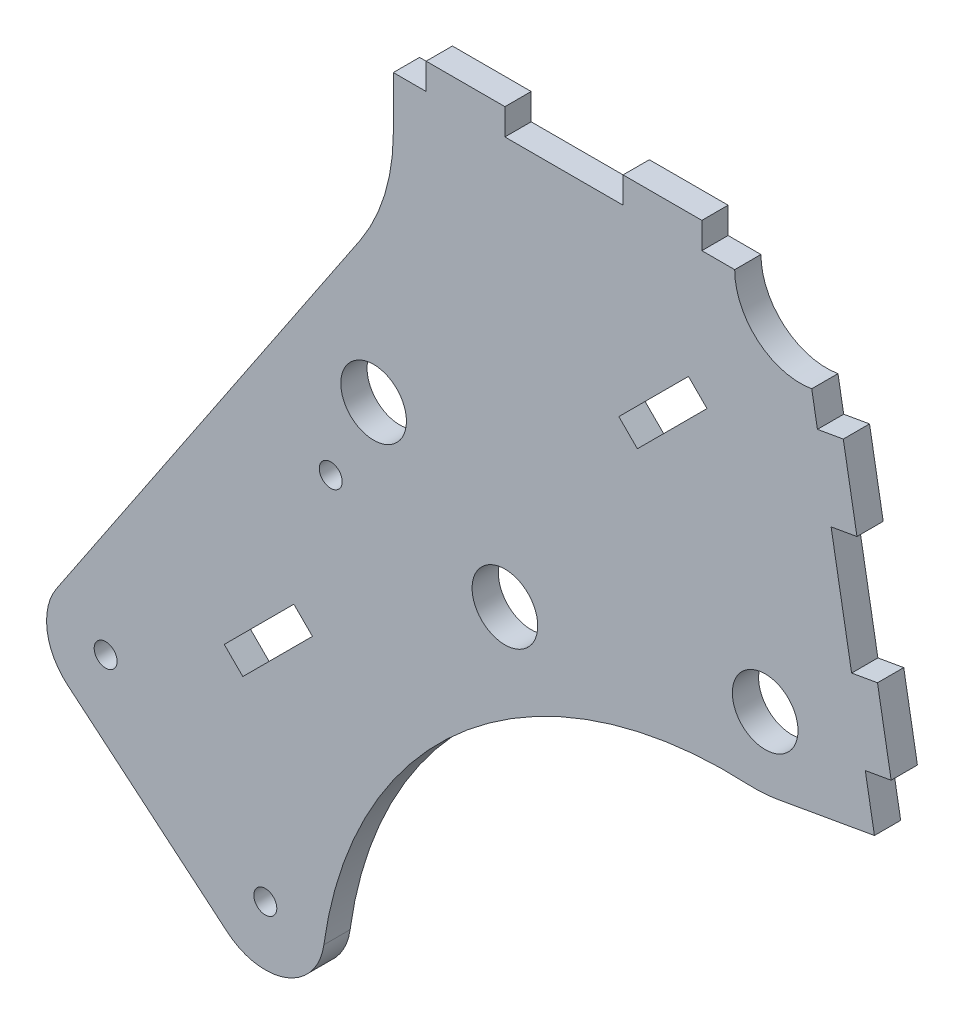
ISO-10303-21;
HEADER;
FILE_DESCRIPTION(('STEP AP214'),'2;1');
FILE_NAME('part.step','',(''),(''),'','','');
FILE_SCHEMA(('AUTOMOTIVE_DESIGN { 1 0 10303 214 1 1 1 1 }'));
ENDSEC;
DATA;
#1=APPLICATION_CONTEXT('core data for automotive mechanical design processes');
#2=APPLICATION_PROTOCOL_DEFINITION('international standard','automotive_design',2000,#1);
#3=PRODUCT_CONTEXT('',#1,'mechanical');
#4=PRODUCT('Part','Part','',(#3));
#5=PRODUCT_RELATED_PRODUCT_CATEGORY('part','',(#4));
#6=PRODUCT_DEFINITION_FORMATION('','',#4);
#7=PRODUCT_DEFINITION_CONTEXT('part definition',#1,'design');
#8=PRODUCT_DEFINITION('design','',#6,#7);
#9=PRODUCT_DEFINITION_SHAPE('','',#8);
#10=(LENGTH_UNIT() NAMED_UNIT(*) SI_UNIT(.MILLI.,.METRE.));
#11=(NAMED_UNIT(*) PLANE_ANGLE_UNIT() SI_UNIT($,.RADIAN.));
#12=(NAMED_UNIT(*) SI_UNIT($,.STERADIAN.) SOLID_ANGLE_UNIT());
#13=UNCERTAINTY_MEASURE_WITH_UNIT(LENGTH_MEASURE(1.E-05),#10,'distance_accuracy_value','');
#14=(GEOMETRIC_REPRESENTATION_CONTEXT(3) GLOBAL_UNCERTAINTY_ASSIGNED_CONTEXT((#13)) GLOBAL_UNIT_ASSIGNED_CONTEXT((#10,
#11,#12)) REPRESENTATION_CONTEXT('',''));
#15=CARTESIAN_POINT('',(0.,0.,0.));
#16=DIRECTION('',(0.,0.,1.));
#17=DIRECTION('',(1.,0.,0.));
#18=AXIS2_PLACEMENT_3D('',#15,#16,#17);
#19=CARTESIAN_POINT('',(0.,0.,4.));
#20=DIRECTION('',(0.,0.,1.));
#21=DIRECTION('',(1.,0.,0.));
#22=AXIS2_PLACEMENT_3D('',#19,#20,#21);
#23=PLANE('',#22);
#24=DIRECTION('',(-0.707106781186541,-0.707106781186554,0.));
#25=VECTOR('',#24,1.);
#26=CARTESIAN_POINT('',(-77.1453498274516,-77.7110352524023,4.));
#27=LINE('',#26,#25);
#28=CARTESIAN_POINT('',(-77.1453498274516,-77.7110352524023,4.));
#29=VERTEX_POINT('',#28);
#30=CARTESIAN_POINT('',(-87.7519515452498,-88.3176369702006,4.));
#31=VERTEX_POINT('',#30);
#32=EDGE_CURVE('E303',#29,#31,#27,.T.);
#33=ORIENTED_EDGE('',*,*,#32,.F.);
#34=DIRECTION('',(-0.707106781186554,0.707106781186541,0.));
#35=VECTOR('',#34,1.);
#36=CARTESIAN_POINT('',(-74.3169227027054,-80.5394623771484,4.));
#37=LINE('',#36,#35);
#38=CARTESIAN_POINT('',(-74.3169227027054,-80.5394623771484,4.));
#39=VERTEX_POINT('',#38);
#40=EDGE_CURVE('E301',#39,#29,#37,.T.);
#41=ORIENTED_EDGE('',*,*,#40,.F.);
#42=DIRECTION('',(0.707106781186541,0.707106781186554,0.));
#43=VECTOR('',#42,1.);
#44=CARTESIAN_POINT('',(-84.9235244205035,-91.1460640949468,4.));
#45=LINE('',#44,#43);
#46=CARTESIAN_POINT('',(-84.9235244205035,-91.1460640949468,4.));
#47=VERTEX_POINT('',#46);
#48=EDGE_CURVE('E309',#47,#39,#45,.T.);
#49=ORIENTED_EDGE('',*,*,#48,.F.);
#50=DIRECTION('',(0.707106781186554,-0.707106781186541,0.));
#51=VECTOR('',#50,1.);
#52=CARTESIAN_POINT('',(-87.7519515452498,-88.3176369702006,4.));
#53=LINE('',#52,#51);
#54=EDGE_CURVE('E306',#31,#47,#53,.T.);
#55=ORIENTED_EDGE('',*,*,#54,.F.);
#56=EDGE_LOOP('',(#33,#41,#49,#55));
#57=FACE_BOUND('',#56,.T.);
#58=CARTESIAN_POINT('',(-65.,-45.,4.));
#59=DIRECTION('',(0.,0.,1.));
#60=DIRECTION('',(1.,0.,0.));
#61=AXIS2_PLACEMENT_3D('',#58,#59,#60);
#62=CIRCLE('',#61,5.00000000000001);
#63=CARTESIAN_POINT('',(-60.,-45.,4.));
#64=VERTEX_POINT('',#63);
#65=EDGE_CURVE('E338',#64,#64,#62,.T.);
#66=ORIENTED_EDGE('',*,*,#65,.F.);
#67=EDGE_LOOP('',(#66));
#68=FACE_BOUND('',#67,.T.);
#69=CARTESIAN_POINT('',(-71.5325312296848,-57.8684117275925,4.));
#70=DIRECTION('',(0.,0.,1.));
#71=DIRECTION('',(1.,0.,0.));
#72=AXIS2_PLACEMENT_3D('',#69,#70,#71);
#73=CIRCLE('',#72,1.75000000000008);
#74=CARTESIAN_POINT('',(-69.7825312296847,-57.8684117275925,4.));
#75=VERTEX_POINT('',#74);
#76=EDGE_CURVE('E350',#75,#75,#73,.T.);
#77=ORIENTED_EDGE('',*,*,#76,.F.);
#78=EDGE_LOOP('',(#77));
#79=FACE_BOUND('',#78,.T.);
#80=CARTESIAN_POINT('',(-81.4969112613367,-119.137728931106,4.));
#81=DIRECTION('',(0.,0.,1.));
#82=DIRECTION('',(1.,0.,0.));
#83=AXIS2_PLACEMENT_3D('',#80,#81,#82);
#84=CIRCLE('',#83,1.74999999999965);
#85=CARTESIAN_POINT('',(-79.7469112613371,-119.137728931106,4.));
#86=VERTEX_POINT('',#85);
#87=EDGE_CURVE('E362',#86,#86,#84,.T.);
#88=ORIENTED_EDGE('',*,*,#87,.F.);
#89=EDGE_LOOP('',(#88));
#90=FACE_BOUND('',#89,.T.);
#91=CARTESIAN_POINT('',(0.,0.,4.));
#92=DIRECTION('',(0.,0.,-1.));
#93=DIRECTION('',(1.,0.,0.));
#94=AXIS2_PLACEMENT_3D('',#91,#92,#93);
#95=CIRCLE('',#94,10.);
#96=CARTESIAN_POINT('',(1.73648177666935,-9.84807753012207,4.));
#97=VERTEX_POINT('',#96);
#98=CARTESIAN_POINT('',(-10.,0.,4.));
#99=VERTEX_POINT('',#98);
#100=EDGE_CURVE('E368',#97,#99,#95,.T.);
#101=ORIENTED_EDGE('',*,*,#100,.T.);
#102=DIRECTION('',(-1.,0.,0.));
#103=VECTOR('',#102,1.);
#104=CARTESIAN_POINT('',(-10.,0.,4.));
#105=LINE('',#104,#103);
#106=CARTESIAN_POINT('',(-15.,0.,4.));
#107=VERTEX_POINT('',#106);
#108=EDGE_CURVE('E371',#99,#107,#105,.T.);
#109=ORIENTED_EDGE('',*,*,#108,.T.);
#110=DIRECTION('',(0.,1.,0.));
#111=VECTOR('',#110,1.);
#112=CARTESIAN_POINT('',(-15.,0.,4.));
#113=LINE('',#112,#111);
#114=CARTESIAN_POINT('',(-15.,4.,4.));
#115=VERTEX_POINT('',#114);
#116=EDGE_CURVE('E374',#107,#115,#113,.T.);
#117=ORIENTED_EDGE('',*,*,#116,.T.);
#118=DIRECTION('',(-1.,0.,0.));
#119=VECTOR('',#118,1.);
#120=CARTESIAN_POINT('',(-15.,4.,4.));
#121=LINE('',#120,#119);
#122=CARTESIAN_POINT('',(-27.,4.,4.));
#123=VERTEX_POINT('',#122);
#124=EDGE_CURVE('E376',#115,#123,#121,.T.);
#125=ORIENTED_EDGE('',*,*,#124,.T.);
#126=DIRECTION('',(0.,-1.,0.));
#127=VECTOR('',#126,1.);
#128=CARTESIAN_POINT('',(-27.,4.,4.));
#129=LINE('',#128,#127);
#130=CARTESIAN_POINT('',(-27.,0.,4.));
#131=VERTEX_POINT('',#130);
#132=EDGE_CURVE('E378',#123,#131,#129,.T.);
#133=ORIENTED_EDGE('',*,*,#132,.T.);
#134=DIRECTION('',(-1.,0.,0.));
#135=VECTOR('',#134,1.);
#136=CARTESIAN_POINT('',(-27.,0.,4.));
#137=LINE('',#136,#135);
#138=CARTESIAN_POINT('',(-45.,0.,4.));
#139=VERTEX_POINT('',#138);
#140=EDGE_CURVE('E380',#131,#139,#137,.T.);
#141=ORIENTED_EDGE('',*,*,#140,.T.);
#142=DIRECTION('',(0.,1.,0.));
#143=VECTOR('',#142,1.);
#144=CARTESIAN_POINT('',(-45.,0.,4.));
#145=LINE('',#144,#143);
#146=CARTESIAN_POINT('',(-45.,4.,4.));
#147=VERTEX_POINT('',#146);
#148=EDGE_CURVE('E382',#139,#147,#145,.T.);
#149=ORIENTED_EDGE('',*,*,#148,.T.);
#150=DIRECTION('',(-1.,0.,0.));
#151=VECTOR('',#150,1.);
#152=CARTESIAN_POINT('',(-45.,4.,4.));
#153=LINE('',#152,#151);
#154=CARTESIAN_POINT('',(-57.,3.99999999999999,4.));
#155=VERTEX_POINT('',#154);
#156=EDGE_CURVE('E384',#147,#155,#153,.T.);
#157=ORIENTED_EDGE('',*,*,#156,.T.);
#158=DIRECTION('',(0.,-1.,0.));
#159=VECTOR('',#158,1.);
#160=CARTESIAN_POINT('',(-57.,3.99999999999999,4.));
#161=LINE('',#160,#159);
#162=CARTESIAN_POINT('',(-57.,0.,4.));
#163=VERTEX_POINT('',#162);
#164=EDGE_CURVE('E386',#155,#163,#161,.T.);
#165=ORIENTED_EDGE('',*,*,#164,.T.);
#166=DIRECTION('',(-1.,0.,0.));
#167=VECTOR('',#166,1.);
#168=CARTESIAN_POINT('',(-57.,0.,4.));
#169=LINE('',#168,#167);
#170=CARTESIAN_POINT('',(-62.,0.,4.));
#171=VERTEX_POINT('',#170);
#172=EDGE_CURVE('E388',#163,#171,#169,.T.);
#173=ORIENTED_EDGE('',*,*,#172,.T.);
#174=DIRECTION('',(0.,-1.,0.));
#175=VECTOR('',#174,1.);
#176=CARTESIAN_POINT('',(-62.,0.,4.));
#177=LINE('',#176,#175);
#178=CARTESIAN_POINT('',(-62.,-8.,4.));
#179=VERTEX_POINT('',#178);
#180=EDGE_CURVE('E390',#171,#179,#177,.T.);
#181=ORIENTED_EDGE('',*,*,#180,.T.);
#182=CARTESIAN_POINT('',(-92.,-8.00000000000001,4.));
#183=DIRECTION('',(0.,0.,-1.));
#184=DIRECTION('',(1.,0.,0.));
#185=AXIS2_PLACEMENT_3D('',#182,#183,#184);
#186=CIRCLE('',#185,30.);
#187=CARTESIAN_POINT('',(-67.0726673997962,-24.6921565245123,4.));
#188=VERTEX_POINT('',#187);
#189=EDGE_CURVE('E392',#179,#188,#186,.T.);
#190=ORIENTED_EDGE('',*,*,#189,.T.);
#191=DIRECTION('',(-0.556405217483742,-0.83091108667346,0.));
#192=VECTOR('',#191,1.);
#193=CARTESIAN_POINT('',(-113.297022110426,-93.7215753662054,4.));
#194=LINE('',#193,#192);
#195=CARTESIAN_POINT('',(-113.297022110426,-93.7215753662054,4.));
#196=VERTEX_POINT('',#195);
#197=EDGE_CURVE('E394',#188,#196,#194,.T.);
#198=ORIENTED_EDGE('',*,*,#197,.T.);
#199=CARTESIAN_POINT('',(-105.818822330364,-98.7292223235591,4.));
#200=DIRECTION('',(0.,0.,1.));
#201=DIRECTION('',(1.,0.,0.));
#202=AXIS2_PLACEMENT_3D('',#199,#200,#201);
#203=CIRCLE('',#202,9.);
#204=CARTESIAN_POINT('',(-111.603910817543,-105.62362231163,4.));
#205=VERTEX_POINT('',#204);
#206=EDGE_CURVE('E396',#196,#205,#203,.T.);
#207=ORIENTED_EDGE('',*,*,#206,.T.);
#208=DIRECTION('',(0.766044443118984,-0.642787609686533,0.));
#209=VECTOR('',#208,1.);
#210=CARTESIAN_POINT('',(-111.603910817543,-105.62362231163,4.));
#211=LINE('',#210,#209);
#212=CARTESIAN_POINT('',(-87.2819997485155,-126.032128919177,4.));
#213=VERTEX_POINT('',#212);
#214=EDGE_CURVE('E398',#205,#213,#211,.T.);
#215=ORIENTED_EDGE('',*,*,#214,.T.);
#216=CARTESIAN_POINT('',(-81.4969112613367,-119.137728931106,4.));
#217=DIRECTION('',(0.,0.,1.));
#218=DIRECTION('',(1.,0.,0.));
#219=AXIS2_PLACEMENT_3D('',#216,#217,#218);
#220=CIRCLE('',#219,8.99999999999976);
#221=CARTESIAN_POINT('',(-72.5808738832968,-120.364218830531,4.));
#222=VERTEX_POINT('',#221);
#223=EDGE_CURVE('E400',#213,#222,#220,.T.);
#224=ORIENTED_EDGE('',*,*,#223,.T.);
#225=CARTESIAN_POINT('',(-11.1592830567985,-128.813371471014,4.));
#226=DIRECTION('',(0.,0.,-1.));
#227=DIRECTION('',(-1.,0.,0.));
#228=AXIS2_PLACEMENT_3D('',#225,#226,#227);
#229=CIRCLE('',#228,62.);
#230=CARTESIAN_POINT('',(-7.98266409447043,-66.8948032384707,4.));
#231=VERTEX_POINT('',#230);
#232=EDGE_CURVE('E402',#222,#231,#229,.T.);
#233=ORIENTED_EDGE('',*,*,#232,.T.);
#234=CARTESIAN_POINT('',(-6.95794830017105,-46.9210715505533,4.));
#235=DIRECTION('',(0.,0.,1.));
#236=DIRECTION('',(-1.,0.,0.));
#237=AXIS2_PLACEMENT_3D('',#234,#235,#236);
#238=CIRCLE('',#237,20.);
#239=CARTESIAN_POINT('',(-3.48498474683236,-66.6172266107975,4.));
#240=VERTEX_POINT('',#239);
#241=EDGE_CURVE('E404',#231,#240,#238,.T.);
#242=ORIENTED_EDGE('',*,*,#241,.T.);
#243=DIRECTION('',(0.984807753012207,0.173648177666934,0.));
#244=VECTOR('',#243,1.);
#245=CARTESIAN_POINT('',(11.2871315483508,-64.0125039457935,4.));
#246=LINE('',#245,#244);
#247=CARTESIAN_POINT('',(11.2871315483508,-64.0125039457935,4.));
#248=VERTEX_POINT('',#247);
#249=EDGE_CURVE('E406',#240,#248,#246,.T.);
#250=ORIENTED_EDGE('',*,*,#249,.T.);
#251=DIRECTION('',(-0.173648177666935,0.984807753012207,0.));
#252=VECTOR('',#251,1.);
#253=CARTESIAN_POINT('',(9.89794612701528,-56.1340419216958,4.));
#254=LINE('',#253,#252);
#255=CARTESIAN_POINT('',(9.89794612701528,-56.1340419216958,4.));
#256=VERTEX_POINT('',#255);
#257=EDGE_CURVE('E408',#248,#256,#254,.T.);
#258=ORIENTED_EDGE('',*,*,#257,.T.);
#259=DIRECTION('',(0.984807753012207,0.173648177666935,0.));
#260=VECTOR('',#259,1.);
#261=CARTESIAN_POINT('',(13.8371771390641,-55.4394492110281,4.));
#262=LINE('',#261,#260);
#263=CARTESIAN_POINT('',(13.8371771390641,-55.4394492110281,4.));
#264=VERTEX_POINT('',#263);
#265=EDGE_CURVE('E410',#256,#264,#262,.T.);
#266=ORIENTED_EDGE('',*,*,#265,.T.);
#267=DIRECTION('',(-0.173648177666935,0.984807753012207,0.));
#268=VECTOR('',#267,1.);
#269=CARTESIAN_POINT('',(11.7533990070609,-43.6217561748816,4.));
#270=LINE('',#269,#268);
#271=CARTESIAN_POINT('',(11.7533990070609,-43.6217561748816,4.));
#272=VERTEX_POINT('',#271);
#273=EDGE_CURVE('E412',#264,#272,#270,.T.);
#274=ORIENTED_EDGE('',*,*,#273,.T.);
#275=DIRECTION('',(-0.984807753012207,-0.173648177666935,0.));
#276=VECTOR('',#275,1.);
#277=CARTESIAN_POINT('',(7.81416799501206,-44.3163488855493,4.));
#278=LINE('',#277,#276);
#279=CARTESIAN_POINT('',(7.81416799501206,-44.3163488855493,4.));
#280=VERTEX_POINT('',#279);
#281=EDGE_CURVE('E414',#272,#280,#278,.T.);
#282=ORIENTED_EDGE('',*,*,#281,.T.);
#283=DIRECTION('',(-0.173648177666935,0.984807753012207,0.));
#284=VECTOR('',#283,1.);
#285=CARTESIAN_POINT('',(4.68850079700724,-26.5898093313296,4.));
#286=LINE('',#285,#284);
#287=CARTESIAN_POINT('',(4.68850079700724,-26.5898093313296,4.));
#288=VERTEX_POINT('',#287);
#289=EDGE_CURVE('E416',#280,#288,#286,.T.);
#290=ORIENTED_EDGE('',*,*,#289,.T.);
#291=DIRECTION('',(0.984807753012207,0.173648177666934,0.));
#292=VECTOR('',#291,1.);
#293=CARTESIAN_POINT('',(8.62773180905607,-25.8952166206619,4.));
#294=LINE('',#293,#292);
#295=CARTESIAN_POINT('',(8.62773180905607,-25.8952166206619,4.));
#296=VERTEX_POINT('',#295);
#297=EDGE_CURVE('E418',#288,#296,#294,.T.);
#298=ORIENTED_EDGE('',*,*,#297,.T.);
#299=DIRECTION('',(-0.173648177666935,0.984807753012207,0.));
#300=VECTOR('',#299,1.);
#301=CARTESIAN_POINT('',(6.54395367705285,-14.0775235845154,4.));
#302=LINE('',#301,#300);
#303=CARTESIAN_POINT('',(6.54395367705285,-14.0775235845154,4.));
#304=VERTEX_POINT('',#303);
#305=EDGE_CURVE('E420',#296,#304,#302,.T.);
#306=ORIENTED_EDGE('',*,*,#305,.T.);
#307=DIRECTION('',(-0.984807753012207,-0.173648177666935,0.));
#308=VECTOR('',#307,1.);
#309=CARTESIAN_POINT('',(2.60472266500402,-14.7721162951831,4.));
#310=LINE('',#309,#308);
#311=CARTESIAN_POINT('',(2.60472266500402,-14.7721162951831,4.));
#312=VERTEX_POINT('',#311);
#313=EDGE_CURVE('E422',#304,#312,#310,.T.);
#314=ORIENTED_EDGE('',*,*,#313,.T.);
#315=DIRECTION('',(-0.173648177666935,0.984807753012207,0.));
#316=VECTOR('',#315,1.);
#317=CARTESIAN_POINT('',(1.73648177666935,-9.84807753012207,4.));
#318=LINE('',#317,#316);
#319=EDGE_CURVE('E424',#312,#97,#318,.T.);
#320=ORIENTED_EDGE('',*,*,#319,.T.);
#321=EDGE_LOOP('',(#101,#109,#117,#125,#133,#141,#149,#157,#165,#173,#181,#190,#198,#207,#215,
#224,#233,#242,#250,#258,#266,#274,#282,#290,#298,#306,#314,#320));
#322=FACE_BOUND('',#321,.T.);
#323=CARTESIAN_POINT('',(-105.818822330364,-98.7292223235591,4.));
#324=DIRECTION('',(0.,0.,1.));
#325=DIRECTION('',(1.,0.,0.));
#326=AXIS2_PLACEMENT_3D('',#323,#324,#325);
#327=CIRCLE('',#326,1.74999999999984);
#328=CARTESIAN_POINT('',(-104.068822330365,-98.7292223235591,4.));
#329=VERTEX_POINT('',#328);
#330=EDGE_CURVE('E356',#329,#329,#327,.T.);
#331=ORIENTED_EDGE('',*,*,#330,.F.);
#332=EDGE_LOOP('',(#331));
#333=FACE_BOUND('',#332,.T.);
#334=CARTESIAN_POINT('',(-5.35708825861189,-56.,4.));
#335=DIRECTION('',(0.,0.,1.));
#336=DIRECTION('',(1.,0.,0.));
#337=AXIS2_PLACEMENT_3D('',#334,#335,#336);
#338=CIRCLE('',#337,5.);
#339=CARTESIAN_POINT('',(-0.357088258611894,-56.,4.));
#340=VERTEX_POINT('',#339);
#341=EDGE_CURVE('E344',#340,#340,#338,.T.);
#342=ORIENTED_EDGE('',*,*,#341,.F.);
#343=EDGE_LOOP('',(#342));
#344=FACE_BOUND('',#343,.T.);
#345=CARTESIAN_POINT('',(-45.,-62.,4.));
#346=DIRECTION('',(0.,0.,1.));
#347=DIRECTION('',(1.,0.,0.));
#348=AXIS2_PLACEMENT_3D('',#345,#346,#347);
#349=CIRCLE('',#348,5.);
#350=CARTESIAN_POINT('',(-40.,-62.,4.));
#351=VERTEX_POINT('',#350);
#352=EDGE_CURVE('E332',#351,#351,#349,.T.);
#353=ORIENTED_EDGE('',*,*,#352,.F.);
#354=EDGE_LOOP('',(#353));
#355=FACE_BOUND('',#354,.T.);
#356=DIRECTION('',(0.707106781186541,0.707106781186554,0.));
#357=VECTOR('',#356,1.);
#358=CARTESIAN_POINT('',(-14.2128463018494,-20.4353859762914,4.));
#359=LINE('',#358,#357);
#360=CARTESIAN_POINT('',(-24.8194480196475,-31.0419876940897,4.));
#361=VERTEX_POINT('',#360);
#362=CARTESIAN_POINT('',(-14.2128463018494,-20.4353859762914,4.));
#363=VERTEX_POINT('',#362);
#364=EDGE_CURVE('E273',#361,#363,#359,.T.);
#365=ORIENTED_EDGE('',*,*,#364,.F.);
#366=DIRECTION('',(0.707106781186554,-0.707106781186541,0.));
#367=VECTOR('',#366,1.);
#368=CARTESIAN_POINT('',(-24.8194480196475,-31.0419876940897,4.));
#369=LINE('',#368,#367);
#370=CARTESIAN_POINT('',(-27.6478751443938,-28.2135605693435,4.));
#371=VERTEX_POINT('',#370);
#372=EDGE_CURVE('E265',#371,#361,#369,.T.);
#373=ORIENTED_EDGE('',*,*,#372,.F.);
#374=DIRECTION('',(-0.707106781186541,-0.707106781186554,0.));
#375=VECTOR('',#374,1.);
#376=CARTESIAN_POINT('',(-27.6478751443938,-28.2135605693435,4.));
#377=LINE('',#376,#375);
#378=CARTESIAN_POINT('',(-17.0412734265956,-17.6069588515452,4.));
#379=VERTEX_POINT('',#378);
#380=EDGE_CURVE('E287',#379,#371,#377,.T.);
#381=ORIENTED_EDGE('',*,*,#380,.F.);
#382=DIRECTION('',(-0.707106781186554,0.707106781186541,0.));
#383=VECTOR('',#382,1.);
#384=CARTESIAN_POINT('',(-17.0412734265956,-17.6069588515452,4.));
#385=LINE('',#384,#383);
#386=EDGE_CURVE('E285',#363,#379,#385,.T.);
#387=ORIENTED_EDGE('',*,*,#386,.F.);
#388=EDGE_LOOP('',(#365,#373,#381,#387));
#389=FACE_BOUND('',#388,.T.);
#390=ADVANCED_FACE('F32',(#57,#68,#79,#90,#322,#333,#344,#355,#389),#23,.T.);
#391=CARTESIAN_POINT('',(0.,0.,0.));
#392=DIRECTION('',(0.,0.,1.));
#393=DIRECTION('',(1.,0.,0.));
#394=AXIS2_PLACEMENT_3D('',#391,#392,#393);
#395=PLANE('',#394);
#396=DIRECTION('',(-0.707106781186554,0.707106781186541,0.));
#397=VECTOR('',#396,1.);
#398=CARTESIAN_POINT('',(-74.3169227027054,-80.5394623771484,0.));
#399=LINE('',#398,#397);
#400=CARTESIAN_POINT('',(-74.3169227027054,-80.5394623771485,0.));
#401=VERTEX_POINT('',#400);
#402=CARTESIAN_POINT('',(-77.1453498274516,-77.7110352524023,0.));
#403=VERTEX_POINT('',#402);
#404=EDGE_CURVE('E281',#401,#403,#399,.T.);
#405=ORIENTED_EDGE('',*,*,#404,.T.);
#406=DIRECTION('',(-0.707106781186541,-0.707106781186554,0.));
#407=VECTOR('',#406,1.);
#408=CARTESIAN_POINT('',(-77.1453498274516,-77.7110352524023,0.));
#409=LINE('',#408,#407);
#410=CARTESIAN_POINT('',(-87.7519515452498,-88.3176369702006,0.));
#411=VERTEX_POINT('',#410);
#412=EDGE_CURVE('E314',#403,#411,#409,.T.);
#413=ORIENTED_EDGE('',*,*,#412,.T.);
#414=DIRECTION('',(0.707106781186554,-0.707106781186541,0.));
#415=VECTOR('',#414,1.);
#416=CARTESIAN_POINT('',(-87.7519515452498,-88.3176369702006,0.));
#417=LINE('',#416,#415);
#418=CARTESIAN_POINT('',(-84.9235244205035,-91.1460640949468,0.));
#419=VERTEX_POINT('',#418);
#420=EDGE_CURVE('E317',#411,#419,#417,.T.);
#421=ORIENTED_EDGE('',*,*,#420,.T.);
#422=DIRECTION('',(0.707106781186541,0.707106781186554,0.));
#423=VECTOR('',#422,1.);
#424=CARTESIAN_POINT('',(-84.9235244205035,-91.1460640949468,0.));
#425=LINE('',#424,#423);
#426=EDGE_CURVE('E304',#419,#401,#425,.T.);
#427=ORIENTED_EDGE('',*,*,#426,.T.);
#428=EDGE_LOOP('',(#405,#413,#421,#427));
#429=FACE_BOUND('',#428,.T.);
#430=CARTESIAN_POINT('',(-65.,-45.,0.));
#431=DIRECTION('',(0.,0.,1.));
#432=DIRECTION('',(1.,0.,0.));
#433=AXIS2_PLACEMENT_3D('',#430,#431,#432);
#434=CIRCLE('',#433,5.00000000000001);
#435=CARTESIAN_POINT('',(-60.,-45.,0.));
#436=VERTEX_POINT('',#435);
#437=EDGE_CURVE('E335',#436,#436,#434,.T.);
#438=ORIENTED_EDGE('',*,*,#437,.T.);
#439=EDGE_LOOP('',(#438));
#440=FACE_BOUND('',#439,.T.);
#441=CARTESIAN_POINT('',(-71.5325312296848,-57.8684117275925,0.));
#442=DIRECTION('',(0.,0.,1.));
#443=DIRECTION('',(1.,0.,0.));
#444=AXIS2_PLACEMENT_3D('',#441,#442,#443);
#445=CIRCLE('',#444,1.75000000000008);
#446=CARTESIAN_POINT('',(-69.7825312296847,-57.8684117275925,0.));
#447=VERTEX_POINT('',#446);
#448=EDGE_CURVE('E347',#447,#447,#445,.T.);
#449=ORIENTED_EDGE('',*,*,#448,.T.);
#450=EDGE_LOOP('',(#449));
#451=FACE_BOUND('',#450,.T.);
#452=CARTESIAN_POINT('',(-81.4969112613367,-119.137728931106,0.));
#453=DIRECTION('',(0.,0.,1.));
#454=DIRECTION('',(1.,0.,0.));
#455=AXIS2_PLACEMENT_3D('',#452,#453,#454);
#456=CIRCLE('',#455,1.74999999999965);
#457=CARTESIAN_POINT('',(-79.7469112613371,-119.137728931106,0.));
#458=VERTEX_POINT('',#457);
#459=EDGE_CURVE('E359',#458,#458,#456,.T.);
#460=ORIENTED_EDGE('',*,*,#459,.T.);
#461=EDGE_LOOP('',(#460));
#462=FACE_BOUND('',#461,.T.);
#463=CARTESIAN_POINT('',(0.,0.,0.));
#464=DIRECTION('',(0.,0.,-1.));
#465=DIRECTION('',(1.,0.,0.));
#466=AXIS2_PLACEMENT_3D('',#463,#464,#465);
#467=CIRCLE('',#466,10.);
#468=CARTESIAN_POINT('',(1.73648177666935,-9.84807753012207,0.));
#469=VERTEX_POINT('',#468);
#470=CARTESIAN_POINT('',(-10.,0.,0.));
#471=VERTEX_POINT('',#470);
#472=EDGE_CURVE('E365',#469,#471,#467,.T.);
#473=ORIENTED_EDGE('',*,*,#472,.F.);
#474=DIRECTION('',(-0.173648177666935,0.984807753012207,0.));
#475=VECTOR('',#474,1.);
#476=CARTESIAN_POINT('',(1.73648177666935,-9.84807753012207,0.));
#477=LINE('',#476,#475);
#478=CARTESIAN_POINT('',(2.60472266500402,-14.7721162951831,0.));
#479=VERTEX_POINT('',#478);
#480=EDGE_CURVE('E372',#479,#469,#477,.T.);
#481=ORIENTED_EDGE('',*,*,#480,.F.);
#482=DIRECTION('',(-0.984807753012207,-0.173648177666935,0.));
#483=VECTOR('',#482,1.);
#484=CARTESIAN_POINT('',(2.60472266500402,-14.7721162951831,0.));
#485=LINE('',#484,#483);
#486=CARTESIAN_POINT('',(6.54395367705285,-14.0775235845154,0.));
#487=VERTEX_POINT('',#486);
#488=EDGE_CURVE('E479',#487,#479,#485,.T.);
#489=ORIENTED_EDGE('',*,*,#488,.F.);
#490=DIRECTION('',(-0.173648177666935,0.984807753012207,0.));
#491=VECTOR('',#490,1.);
#492=CARTESIAN_POINT('',(6.54395367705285,-14.0775235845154,0.));
#493=LINE('',#492,#491);
#494=CARTESIAN_POINT('',(8.62773180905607,-25.8952166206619,0.));
#495=VERTEX_POINT('',#494);
#496=EDGE_CURVE('E477',#495,#487,#493,.T.);
#497=ORIENTED_EDGE('',*,*,#496,.F.);
#498=DIRECTION('',(0.984807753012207,0.173648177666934,0.));
#499=VECTOR('',#498,1.);
#500=CARTESIAN_POINT('',(8.62773180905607,-25.8952166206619,0.));
#501=LINE('',#500,#499);
#502=CARTESIAN_POINT('',(4.68850079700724,-26.5898093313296,0.));
#503=VERTEX_POINT('',#502);
#504=EDGE_CURVE('E475',#503,#495,#501,.T.);
#505=ORIENTED_EDGE('',*,*,#504,.F.);
#506=DIRECTION('',(-0.173648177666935,0.984807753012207,0.));
#507=VECTOR('',#506,1.);
#508=CARTESIAN_POINT('',(4.68850079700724,-26.5898093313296,0.));
#509=LINE('',#508,#507);
#510=CARTESIAN_POINT('',(7.81416799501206,-44.3163488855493,0.));
#511=VERTEX_POINT('',#510);
#512=EDGE_CURVE('E473',#511,#503,#509,.T.);
#513=ORIENTED_EDGE('',*,*,#512,.F.);
#514=DIRECTION('',(-0.984807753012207,-0.173648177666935,0.));
#515=VECTOR('',#514,1.);
#516=CARTESIAN_POINT('',(7.81416799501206,-44.3163488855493,0.));
#517=LINE('',#516,#515);
#518=CARTESIAN_POINT('',(11.7533990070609,-43.6217561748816,0.));
#519=VERTEX_POINT('',#518);
#520=EDGE_CURVE('E471',#519,#511,#517,.T.);
#521=ORIENTED_EDGE('',*,*,#520,.F.);
#522=DIRECTION('',(-0.173648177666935,0.984807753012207,0.));
#523=VECTOR('',#522,1.);
#524=CARTESIAN_POINT('',(11.7533990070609,-43.6217561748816,0.));
#525=LINE('',#524,#523);
#526=CARTESIAN_POINT('',(13.8371771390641,-55.4394492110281,0.));
#527=VERTEX_POINT('',#526);
#528=EDGE_CURVE('E469',#527,#519,#525,.T.);
#529=ORIENTED_EDGE('',*,*,#528,.F.);
#530=DIRECTION('',(0.984807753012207,0.173648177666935,0.));
#531=VECTOR('',#530,1.);
#532=CARTESIAN_POINT('',(13.8371771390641,-55.4394492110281,0.));
#533=LINE('',#532,#531);
#534=CARTESIAN_POINT('',(9.89794612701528,-56.1340419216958,0.));
#535=VERTEX_POINT('',#534);
#536=EDGE_CURVE('E467',#535,#527,#533,.T.);
#537=ORIENTED_EDGE('',*,*,#536,.F.);
#538=DIRECTION('',(-0.173648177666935,0.984807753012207,0.));
#539=VECTOR('',#538,1.);
#540=CARTESIAN_POINT('',(9.89794612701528,-56.1340419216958,0.));
#541=LINE('',#540,#539);
#542=CARTESIAN_POINT('',(11.2871315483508,-64.0125039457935,0.));
#543=VERTEX_POINT('',#542);
#544=EDGE_CURVE('E465',#543,#535,#541,.T.);
#545=ORIENTED_EDGE('',*,*,#544,.F.);
#546=DIRECTION('',(0.984807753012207,0.173648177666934,0.));
#547=VECTOR('',#546,1.);
#548=CARTESIAN_POINT('',(11.2871315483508,-64.0125039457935,0.));
#549=LINE('',#548,#547);
#550=CARTESIAN_POINT('',(-3.48498474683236,-66.6172266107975,0.));
#551=VERTEX_POINT('',#550);
#552=EDGE_CURVE('E463',#551,#543,#549,.T.);
#553=ORIENTED_EDGE('',*,*,#552,.F.);
#554=CARTESIAN_POINT('',(-6.95794830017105,-46.9210715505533,0.));
#555=DIRECTION('',(0.,0.,1.));
#556=DIRECTION('',(-1.,0.,0.));
#557=AXIS2_PLACEMENT_3D('',#554,#555,#556);
#558=CIRCLE('',#557,20.);
#559=CARTESIAN_POINT('',(-7.98266409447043,-66.8948032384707,0.));
#560=VERTEX_POINT('',#559);
#561=EDGE_CURVE('E461',#560,#551,#558,.T.);
#562=ORIENTED_EDGE('',*,*,#561,.F.);
#563=CARTESIAN_POINT('',(-11.1592830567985,-128.813371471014,0.));
#564=DIRECTION('',(0.,0.,-1.));
#565=DIRECTION('',(-1.,0.,0.));
#566=AXIS2_PLACEMENT_3D('',#563,#564,#565);
#567=CIRCLE('',#566,62.);
#568=CARTESIAN_POINT('',(-72.5808738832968,-120.364218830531,0.));
#569=VERTEX_POINT('',#568);
#570=EDGE_CURVE('E459',#569,#560,#567,.T.);
#571=ORIENTED_EDGE('',*,*,#570,.F.);
#572=CARTESIAN_POINT('',(-81.4969112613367,-119.137728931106,0.));
#573=DIRECTION('',(0.,0.,1.));
#574=DIRECTION('',(1.,0.,0.));
#575=AXIS2_PLACEMENT_3D('',#572,#573,#574);
#576=CIRCLE('',#575,8.99999999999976);
#577=CARTESIAN_POINT('',(-87.2819997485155,-126.032128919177,0.));
#578=VERTEX_POINT('',#577);
#579=EDGE_CURVE('E457',#578,#569,#576,.T.);
#580=ORIENTED_EDGE('',*,*,#579,.F.);
#581=DIRECTION('',(0.766044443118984,-0.642787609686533,0.));
#582=VECTOR('',#581,1.);
#583=CARTESIAN_POINT('',(-111.603910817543,-105.62362231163,0.));
#584=LINE('',#583,#582);
#585=CARTESIAN_POINT('',(-111.603910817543,-105.62362231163,0.));
#586=VERTEX_POINT('',#585);
#587=EDGE_CURVE('E455',#586,#578,#584,.T.);
#588=ORIENTED_EDGE('',*,*,#587,.F.);
#589=CARTESIAN_POINT('',(-105.818822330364,-98.7292223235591,0.));
#590=DIRECTION('',(0.,0.,1.));
#591=DIRECTION('',(1.,0.,0.));
#592=AXIS2_PLACEMENT_3D('',#589,#590,#591);
#593=CIRCLE('',#592,9.);
#594=CARTESIAN_POINT('',(-113.297022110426,-93.7215753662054,0.));
#595=VERTEX_POINT('',#594);
#596=EDGE_CURVE('E453',#595,#586,#593,.T.);
#597=ORIENTED_EDGE('',*,*,#596,.F.);
#598=DIRECTION('',(-0.556405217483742,-0.83091108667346,0.));
#599=VECTOR('',#598,1.);
#600=CARTESIAN_POINT('',(-113.297022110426,-93.7215753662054,0.));
#601=LINE('',#600,#599);
#602=CARTESIAN_POINT('',(-67.0726673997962,-24.6921565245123,0.));
#603=VERTEX_POINT('',#602);
#604=EDGE_CURVE('E451',#603,#595,#601,.T.);
#605=ORIENTED_EDGE('',*,*,#604,.F.);
#606=CARTESIAN_POINT('',(-92.,-8.00000000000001,0.));
#607=DIRECTION('',(0.,0.,-1.));
#608=DIRECTION('',(1.,0.,0.));
#609=AXIS2_PLACEMENT_3D('',#606,#607,#608);
#610=CIRCLE('',#609,30.);
#611=CARTESIAN_POINT('',(-62.,-8.,0.));
#612=VERTEX_POINT('',#611);
#613=EDGE_CURVE('E449',#612,#603,#610,.T.);
#614=ORIENTED_EDGE('',*,*,#613,.F.);
#615=DIRECTION('',(0.,-1.,0.));
#616=VECTOR('',#615,1.);
#617=CARTESIAN_POINT('',(-62.,0.,0.));
#618=LINE('',#617,#616);
#619=CARTESIAN_POINT('',(-62.,0.,0.));
#620=VERTEX_POINT('',#619);
#621=EDGE_CURVE('E447',#620,#612,#618,.T.);
#622=ORIENTED_EDGE('',*,*,#621,.F.);
#623=DIRECTION('',(-1.,0.,0.));
#624=VECTOR('',#623,1.);
#625=CARTESIAN_POINT('',(-57.,0.,0.));
#626=LINE('',#625,#624);
#627=CARTESIAN_POINT('',(-57.,0.,0.));
#628=VERTEX_POINT('',#627);
#629=EDGE_CURVE('E445',#628,#620,#626,.T.);
#630=ORIENTED_EDGE('',*,*,#629,.F.);
#631=DIRECTION('',(0.,-1.,0.));
#632=VECTOR('',#631,1.);
#633=CARTESIAN_POINT('',(-57.,3.99999999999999,0.));
#634=LINE('',#633,#632);
#635=CARTESIAN_POINT('',(-57.,3.99999999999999,0.));
#636=VERTEX_POINT('',#635);
#637=EDGE_CURVE('E443',#636,#628,#634,.T.);
#638=ORIENTED_EDGE('',*,*,#637,.F.);
#639=DIRECTION('',(-1.,0.,0.));
#640=VECTOR('',#639,1.);
#641=CARTESIAN_POINT('',(-45.,4.,0.));
#642=LINE('',#641,#640);
#643=CARTESIAN_POINT('',(-45.,4.,0.));
#644=VERTEX_POINT('',#643);
#645=EDGE_CURVE('E441',#644,#636,#642,.T.);
#646=ORIENTED_EDGE('',*,*,#645,.F.);
#647=DIRECTION('',(0.,1.,0.));
#648=VECTOR('',#647,1.);
#649=CARTESIAN_POINT('',(-45.,0.,0.));
#650=LINE('',#649,#648);
#651=CARTESIAN_POINT('',(-45.,0.,0.));
#652=VERTEX_POINT('',#651);
#653=EDGE_CURVE('E439',#652,#644,#650,.T.);
#654=ORIENTED_EDGE('',*,*,#653,.F.);
#655=DIRECTION('',(-1.,0.,0.));
#656=VECTOR('',#655,1.);
#657=CARTESIAN_POINT('',(-27.,0.,0.));
#658=LINE('',#657,#656);
#659=CARTESIAN_POINT('',(-27.,0.,0.));
#660=VERTEX_POINT('',#659);
#661=EDGE_CURVE('E437',#660,#652,#658,.T.);
#662=ORIENTED_EDGE('',*,*,#661,.F.);
#663=DIRECTION('',(0.,-1.,0.));
#664=VECTOR('',#663,1.);
#665=CARTESIAN_POINT('',(-27.,4.,0.));
#666=LINE('',#665,#664);
#667=CARTESIAN_POINT('',(-27.,4.,0.));
#668=VERTEX_POINT('',#667);
#669=EDGE_CURVE('E435',#668,#660,#666,.T.);
#670=ORIENTED_EDGE('',*,*,#669,.F.);
#671=DIRECTION('',(-1.,0.,0.));
#672=VECTOR('',#671,1.);
#673=CARTESIAN_POINT('',(-15.,4.,0.));
#674=LINE('',#673,#672);
#675=CARTESIAN_POINT('',(-15.,4.,0.));
#676=VERTEX_POINT('',#675);
#677=EDGE_CURVE('E433',#676,#668,#674,.T.);
#678=ORIENTED_EDGE('',*,*,#677,.F.);
#679=DIRECTION('',(0.,1.,0.));
#680=VECTOR('',#679,1.);
#681=CARTESIAN_POINT('',(-15.,0.,0.));
#682=LINE('',#681,#680);
#683=CARTESIAN_POINT('',(-15.,0.,0.));
#684=VERTEX_POINT('',#683);
#685=EDGE_CURVE('E431',#684,#676,#682,.T.);
#686=ORIENTED_EDGE('',*,*,#685,.F.);
#687=DIRECTION('',(-1.,0.,0.));
#688=VECTOR('',#687,1.);
#689=CARTESIAN_POINT('',(-10.,0.,0.));
#690=LINE('',#689,#688);
#691=EDGE_CURVE('E429',#471,#684,#690,.T.);
#692=ORIENTED_EDGE('',*,*,#691,.F.);
#693=EDGE_LOOP('',(#473,#481,#489,#497,#505,#513,#521,#529,#537,#545,#553,#562,#571,#580,#588,
#597,#605,#614,#622,#630,#638,#646,#654,#662,#670,#678,#686,#692));
#694=FACE_BOUND('',#693,.T.);
#695=CARTESIAN_POINT('',(-105.818822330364,-98.7292223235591,0.));
#696=DIRECTION('',(0.,0.,1.));
#697=DIRECTION('',(1.,0.,0.));
#698=AXIS2_PLACEMENT_3D('',#695,#696,#697);
#699=CIRCLE('',#698,1.74999999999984);
#700=CARTESIAN_POINT('',(-104.068822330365,-98.7292223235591,0.));
#701=VERTEX_POINT('',#700);
#702=EDGE_CURVE('E353',#701,#701,#699,.T.);
#703=ORIENTED_EDGE('',*,*,#702,.T.);
#704=EDGE_LOOP('',(#703));
#705=FACE_BOUND('',#704,.T.);
#706=CARTESIAN_POINT('',(-5.35708825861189,-56.,0.));
#707=DIRECTION('',(0.,0.,1.));
#708=DIRECTION('',(1.,0.,0.));
#709=AXIS2_PLACEMENT_3D('',#706,#707,#708);
#710=CIRCLE('',#709,5.);
#711=CARTESIAN_POINT('',(-0.357088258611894,-56.,0.));
#712=VERTEX_POINT('',#711);
#713=EDGE_CURVE('E341',#712,#712,#710,.T.);
#714=ORIENTED_EDGE('',*,*,#713,.T.);
#715=EDGE_LOOP('',(#714));
#716=FACE_BOUND('',#715,.T.);
#717=CARTESIAN_POINT('',(-45.,-62.,0.));
#718=DIRECTION('',(0.,0.,1.));
#719=DIRECTION('',(1.,0.,0.));
#720=AXIS2_PLACEMENT_3D('',#717,#718,#719);
#721=CIRCLE('',#720,5.);
#722=CARTESIAN_POINT('',(-40.,-62.,0.));
#723=VERTEX_POINT('',#722);
#724=EDGE_CURVE('E331',#723,#723,#721,.T.);
#725=ORIENTED_EDGE('',*,*,#724,.T.);
#726=EDGE_LOOP('',(#725));
#727=FACE_BOUND('',#726,.T.);
#728=DIRECTION('',(0.707106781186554,-0.707106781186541,0.));
#729=VECTOR('',#728,1.);
#730=CARTESIAN_POINT('',(-24.8194480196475,-31.0419876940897,0.));
#731=LINE('',#730,#729);
#732=CARTESIAN_POINT('',(-27.6478751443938,-28.2135605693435,0.));
#733=VERTEX_POINT('',#732);
#734=CARTESIAN_POINT('',(-24.8194480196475,-31.0419876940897,0.));
#735=VERTEX_POINT('',#734);
#736=EDGE_CURVE('E55',#733,#735,#731,.T.);
#737=ORIENTED_EDGE('',*,*,#736,.T.);
#738=DIRECTION('',(0.707106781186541,0.707106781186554,0.));
#739=VECTOR('',#738,1.);
#740=CARTESIAN_POINT('',(-14.2128463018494,-20.4353859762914,0.));
#741=LINE('',#740,#739);
#742=CARTESIAN_POINT('',(-14.2128463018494,-20.4353859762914,0.));
#743=VERTEX_POINT('',#742);
#744=EDGE_CURVE('E280',#735,#743,#741,.T.);
#745=ORIENTED_EDGE('',*,*,#744,.T.);
#746=DIRECTION('',(-0.707106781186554,0.707106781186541,0.));
#747=VECTOR('',#746,1.);
#748=CARTESIAN_POINT('',(-17.0412734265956,-17.6069588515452,0.));
#749=LINE('',#748,#747);
#750=CARTESIAN_POINT('',(-17.0412734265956,-17.6069588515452,0.));
#751=VERTEX_POINT('',#750);
#752=EDGE_CURVE('E293',#743,#751,#749,.T.);
#753=ORIENTED_EDGE('',*,*,#752,.T.);
#754=DIRECTION('',(-0.707106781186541,-0.707106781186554,0.));
#755=VECTOR('',#754,1.);
#756=CARTESIAN_POINT('',(-27.6478751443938,-28.2135605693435,0.));
#757=LINE('',#756,#755);
#758=EDGE_CURVE('E274',#751,#733,#757,.T.);
#759=ORIENTED_EDGE('',*,*,#758,.T.);
#760=EDGE_LOOP('',(#737,#745,#753,#759));
#761=FACE_BOUND('',#760,.T.);
#762=ADVANCED_FACE('F569',(#429,#440,#451,#462,#694,#705,#716,#727,#761),#395,.F.);
#763=CARTESIAN_POINT('',(0.,0.,4.));
#764=DIRECTION('',(0.,0.,-1.));
#765=DIRECTION('',(-1.,0.,0.));
#766=AXIS2_PLACEMENT_3D('',#763,#764,#765);
#767=CYLINDRICAL_SURFACE('',#766,10.);
#768=ORIENTED_EDGE('',*,*,#472,.T.);
#769=DIRECTION('',(0.,0.,-1.));
#770=VECTOR('',#769,1.);
#771=CARTESIAN_POINT('',(-10.,0.,4.));
#772=LINE('',#771,#770);
#773=EDGE_CURVE('E11',#99,#471,#772,.T.);
#774=ORIENTED_EDGE('',*,*,#773,.F.);
#775=ORIENTED_EDGE('',*,*,#100,.F.);
#776=DIRECTION('',(0.,0.,-1.));
#777=VECTOR('',#776,1.);
#778=CARTESIAN_POINT('',(1.73648177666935,-9.84807753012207,4.));
#779=LINE('',#778,#777);
#780=EDGE_CURVE('E426',#97,#469,#779,.T.);
#781=ORIENTED_EDGE('',*,*,#780,.T.);
#782=EDGE_LOOP('',(#768,#774,#775,#781));
#783=FACE_BOUND('',#782,.T.);
#784=ADVANCED_FACE('F34',(#783),#767,.F.);
#785=CARTESIAN_POINT('',(-10.,0.,4.));
#786=DIRECTION('',(0.,-1.,0.));
#787=DIRECTION('',(0.,0.,-1.));
#788=AXIS2_PLACEMENT_3D('',#785,#786,#787);
#789=PLANE('',#788);
#790=ORIENTED_EDGE('',*,*,#691,.T.);
#791=DIRECTION('',(0.,0.,-1.));
#792=VECTOR('',#791,1.);
#793=CARTESIAN_POINT('',(-15.,0.,4.));
#794=LINE('',#793,#792);
#795=EDGE_CURVE('E40',#107,#684,#794,.T.);
#796=ORIENTED_EDGE('',*,*,#795,.F.);
#797=ORIENTED_EDGE('',*,*,#108,.F.);
#798=ORIENTED_EDGE('',*,*,#773,.T.);
#799=EDGE_LOOP('',(#790,#796,#797,#798));
#800=FACE_BOUND('',#799,.T.);
#801=ADVANCED_FACE('F587',(#800),#789,.F.);
#802=CARTESIAN_POINT('',(-15.,0.,4.));
#803=DIRECTION('',(-1.,0.,0.));
#804=DIRECTION('',(0.,0.,1.));
#805=AXIS2_PLACEMENT_3D('',#802,#803,#804);
#806=PLANE('',#805);
#807=ORIENTED_EDGE('',*,*,#685,.T.);
#808=DIRECTION('',(0.,0.,-1.));
#809=VECTOR('',#808,1.);
#810=CARTESIAN_POINT('',(-15.,4.,4.));
#811=LINE('',#810,#809);
#812=EDGE_CURVE('E556',#115,#676,#811,.T.);
#813=ORIENTED_EDGE('',*,*,#812,.F.);
#814=ORIENTED_EDGE('',*,*,#116,.F.);
#815=ORIENTED_EDGE('',*,*,#795,.T.);
#816=EDGE_LOOP('',(#807,#813,#814,#815));
#817=FACE_BOUND('',#816,.T.);
#818=ADVANCED_FACE('F563',(#817),#806,.F.);
#819=CARTESIAN_POINT('',(-15.,4.,4.));
#820=DIRECTION('',(0.,-1.,0.));
#821=DIRECTION('',(1.,0.,0.));
#822=AXIS2_PLACEMENT_3D('',#819,#820,#821);
#823=PLANE('',#822);
#824=ORIENTED_EDGE('',*,*,#677,.T.);
#825=DIRECTION('',(0.,0.,-1.));
#826=VECTOR('',#825,1.);
#827=CARTESIAN_POINT('',(-27.,4.,4.));
#828=LINE('',#827,#826);
#829=EDGE_CURVE('E553',#123,#668,#828,.T.);
#830=ORIENTED_EDGE('',*,*,#829,.F.);
#831=ORIENTED_EDGE('',*,*,#124,.F.);
#832=ORIENTED_EDGE('',*,*,#812,.T.);
#833=EDGE_LOOP('',(#824,#830,#831,#832));
#834=FACE_BOUND('',#833,.T.);
#835=ADVANCED_FACE('F575',(#834),#823,.F.);
#836=CARTESIAN_POINT('',(-27.,4.,4.));
#837=DIRECTION('',(1.,0.,0.));
#838=DIRECTION('',(0.,0.,-1.));
#839=AXIS2_PLACEMENT_3D('',#836,#837,#838);
#840=PLANE('',#839);
#841=ORIENTED_EDGE('',*,*,#669,.T.);
#842=DIRECTION('',(0.,0.,-1.));
#843=VECTOR('',#842,1.);
#844=CARTESIAN_POINT('',(-27.,0.,4.));
#845=LINE('',#844,#843);
#846=EDGE_CURVE('E550',#131,#660,#845,.T.);
#847=ORIENTED_EDGE('',*,*,#846,.F.);
#848=ORIENTED_EDGE('',*,*,#132,.F.);
#849=ORIENTED_EDGE('',*,*,#829,.T.);
#850=EDGE_LOOP('',(#841,#847,#848,#849));
#851=FACE_BOUND('',#850,.T.);
#852=ADVANCED_FACE('F579',(#851),#840,.F.);
#853=CARTESIAN_POINT('',(-27.,0.,4.));
#854=DIRECTION('',(0.,-1.,0.));
#855=DIRECTION('',(1.,0.,0.));
#856=AXIS2_PLACEMENT_3D('',#853,#854,#855);
#857=PLANE('',#856);
#858=ORIENTED_EDGE('',*,*,#661,.T.);
#859=DIRECTION('',(0.,0.,-1.));
#860=VECTOR('',#859,1.);
#861=CARTESIAN_POINT('',(-45.,0.,4.));
#862=LINE('',#861,#860);
#863=EDGE_CURVE('E547',#139,#652,#862,.T.);
#864=ORIENTED_EDGE('',*,*,#863,.F.);
#865=ORIENTED_EDGE('',*,*,#140,.F.);
#866=ORIENTED_EDGE('',*,*,#846,.T.);
#867=EDGE_LOOP('',(#858,#864,#865,#866));
#868=FACE_BOUND('',#867,.T.);
#869=ADVANCED_FACE('F700',(#868),#857,.F.);
#870=CARTESIAN_POINT('',(-45.,0.,4.));
#871=DIRECTION('',(-1.,0.,0.));
#872=DIRECTION('',(0.,0.,1.));
#873=AXIS2_PLACEMENT_3D('',#870,#871,#872);
#874=PLANE('',#873);
#875=ORIENTED_EDGE('',*,*,#653,.T.);
#876=DIRECTION('',(0.,0.,-1.));
#877=VECTOR('',#876,1.);
#878=CARTESIAN_POINT('',(-45.,4.,4.));
#879=LINE('',#878,#877);
#880=EDGE_CURVE('E544',#147,#644,#879,.T.);
#881=ORIENTED_EDGE('',*,*,#880,.F.);
#882=ORIENTED_EDGE('',*,*,#148,.F.);
#883=ORIENTED_EDGE('',*,*,#863,.T.);
#884=EDGE_LOOP('',(#875,#881,#882,#883));
#885=FACE_BOUND('',#884,.T.);
#886=ADVANCED_FACE('F697',(#885),#874,.F.);
#887=CARTESIAN_POINT('',(-45.,4.,4.));
#888=DIRECTION('',(0.,-1.,0.));
#889=DIRECTION('',(1.,0.,0.));
#890=AXIS2_PLACEMENT_3D('',#887,#888,#889);
#891=PLANE('',#890);
#892=ORIENTED_EDGE('',*,*,#645,.T.);
#893=DIRECTION('',(0.,0.,-1.));
#894=VECTOR('',#893,1.);
#895=CARTESIAN_POINT('',(-57.,3.99999999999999,4.));
#896=LINE('',#895,#894);
#897=EDGE_CURVE('E541',#155,#636,#896,.T.);
#898=ORIENTED_EDGE('',*,*,#897,.F.);
#899=ORIENTED_EDGE('',*,*,#156,.F.);
#900=ORIENTED_EDGE('',*,*,#880,.T.);
#901=EDGE_LOOP('',(#892,#898,#899,#900));
#902=FACE_BOUND('',#901,.T.);
#903=ADVANCED_FACE('F693',(#902),#891,.F.);
#904=CARTESIAN_POINT('',(-57.,3.99999999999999,4.));
#905=DIRECTION('',(1.,0.,0.));
#906=DIRECTION('',(0.,0.,-1.));
#907=AXIS2_PLACEMENT_3D('',#904,#905,#906);
#908=PLANE('',#907);
#909=ORIENTED_EDGE('',*,*,#637,.T.);
#910=DIRECTION('',(0.,0.,-1.));
#911=VECTOR('',#910,1.);
#912=CARTESIAN_POINT('',(-57.,0.,4.));
#913=LINE('',#912,#911);
#914=EDGE_CURVE('E538',#163,#628,#913,.T.);
#915=ORIENTED_EDGE('',*,*,#914,.F.);
#916=ORIENTED_EDGE('',*,*,#164,.F.);
#917=ORIENTED_EDGE('',*,*,#897,.T.);
#918=EDGE_LOOP('',(#909,#915,#916,#917));
#919=FACE_BOUND('',#918,.T.);
#920=ADVANCED_FACE('F689',(#919),#908,.F.);
#921=CARTESIAN_POINT('',(-57.,0.,4.));
#922=DIRECTION('',(0.,-1.,0.));
#923=DIRECTION('',(1.,0.,0.));
#924=AXIS2_PLACEMENT_3D('',#921,#922,#923);
#925=PLANE('',#924);
#926=ORIENTED_EDGE('',*,*,#629,.T.);
#927=DIRECTION('',(0.,0.,-1.));
#928=VECTOR('',#927,1.);
#929=CARTESIAN_POINT('',(-62.,0.,4.));
#930=LINE('',#929,#928);
#931=EDGE_CURVE('E535',#171,#620,#930,.T.);
#932=ORIENTED_EDGE('',*,*,#931,.F.);
#933=ORIENTED_EDGE('',*,*,#172,.F.);
#934=ORIENTED_EDGE('',*,*,#914,.T.);
#935=EDGE_LOOP('',(#926,#932,#933,#934));
#936=FACE_BOUND('',#935,.T.);
#937=ADVANCED_FACE('F684',(#936),#925,.F.);
#938=CARTESIAN_POINT('',(-62.,0.,4.));
#939=DIRECTION('',(1.,0.,0.));
#940=DIRECTION('',(0.,0.,-1.));
#941=AXIS2_PLACEMENT_3D('',#938,#939,#940);
#942=PLANE('',#941);
#943=ORIENTED_EDGE('',*,*,#621,.T.);
#944=DIRECTION('',(0.,0.,-1.));
#945=VECTOR('',#944,1.);
#946=CARTESIAN_POINT('',(-62.,-8.,4.));
#947=LINE('',#946,#945);
#948=EDGE_CURVE('E532',#179,#612,#947,.T.);
#949=ORIENTED_EDGE('',*,*,#948,.F.);
#950=ORIENTED_EDGE('',*,*,#180,.F.);
#951=ORIENTED_EDGE('',*,*,#931,.T.);
#952=EDGE_LOOP('',(#943,#949,#950,#951));
#953=FACE_BOUND('',#952,.T.);
#954=ADVANCED_FACE('F678',(#953),#942,.F.);
#955=CARTESIAN_POINT('',(-92.,-8.00000000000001,4.));
#956=DIRECTION('',(0.,0.,-1.));
#957=DIRECTION('',(-1.,0.,0.));
#958=AXIS2_PLACEMENT_3D('',#955,#956,#957);
#959=CYLINDRICAL_SURFACE('',#958,30.);
#960=ORIENTED_EDGE('',*,*,#613,.T.);
#961=DIRECTION('',(0.,0.,-1.));
#962=VECTOR('',#961,1.);
#963=CARTESIAN_POINT('',(-67.0726673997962,-24.6921565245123,4.));
#964=LINE('',#963,#962);
#965=EDGE_CURVE('E529',#188,#603,#964,.T.);
#966=ORIENTED_EDGE('',*,*,#965,.F.);
#967=ORIENTED_EDGE('',*,*,#189,.F.);
#968=ORIENTED_EDGE('',*,*,#948,.T.);
#969=EDGE_LOOP('',(#960,#966,#967,#968));
#970=FACE_BOUND('',#969,.T.);
#971=ADVANCED_FACE('F674',(#970),#959,.F.);
#972=CARTESIAN_POINT('',(-113.297022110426,-93.7215753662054,4.));
#973=DIRECTION('',(0.83091108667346,-0.556405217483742,0.));
#974=DIRECTION('',(0.556405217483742,0.83091108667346,0.));
#975=AXIS2_PLACEMENT_3D('',#972,#973,#974);
#976=PLANE('',#975);
#977=ORIENTED_EDGE('',*,*,#604,.T.);
#978=DIRECTION('',(0.,0.,-1.));
#979=VECTOR('',#978,1.);
#980=CARTESIAN_POINT('',(-113.297022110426,-93.7215753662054,4.));
#981=LINE('',#980,#979);
#982=EDGE_CURVE('E526',#196,#595,#981,.T.);
#983=ORIENTED_EDGE('',*,*,#982,.F.);
#984=ORIENTED_EDGE('',*,*,#197,.F.);
#985=ORIENTED_EDGE('',*,*,#965,.T.);
#986=EDGE_LOOP('',(#977,#983,#984,#985));
#987=FACE_BOUND('',#986,.T.);
#988=ADVANCED_FACE('F669',(#987),#976,.F.);
#989=CARTESIAN_POINT('',(-105.818822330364,-98.7292223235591,4.));
#990=DIRECTION('',(0.,0.,-1.));
#991=DIRECTION('',(-1.,0.,0.));
#992=AXIS2_PLACEMENT_3D('',#989,#990,#991);
#993=CYLINDRICAL_SURFACE('',#992,9.);
#994=ORIENTED_EDGE('',*,*,#596,.T.);
#995=DIRECTION('',(0.,0.,-1.));
#996=VECTOR('',#995,1.);
#997=CARTESIAN_POINT('',(-111.603910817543,-105.62362231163,4.));
#998=LINE('',#997,#996);
#999=EDGE_CURVE('E523',#205,#586,#998,.T.);
#1000=ORIENTED_EDGE('',*,*,#999,.F.);
#1001=ORIENTED_EDGE('',*,*,#206,.F.);
#1002=ORIENTED_EDGE('',*,*,#982,.T.);
#1003=EDGE_LOOP('',(#994,#1000,#1001,#1002));
#1004=FACE_BOUND('',#1003,.T.);
#1005=ADVANCED_FACE('F663',(#1004),#993,.T.);
#1006=CARTESIAN_POINT('',(-111.603910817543,-105.62362231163,4.));
#1007=DIRECTION('',(0.642787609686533,0.766044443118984,0.));
#1008=DIRECTION('',(-0.766044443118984,0.642787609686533,0.));
#1009=AXIS2_PLACEMENT_3D('',#1006,#1007,#1008);
#1010=PLANE('',#1009);
#1011=ORIENTED_EDGE('',*,*,#587,.T.);
#1012=DIRECTION('',(0.,0.,-1.));
#1013=VECTOR('',#1012,1.);
#1014=CARTESIAN_POINT('',(-87.2819997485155,-126.032128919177,4.));
#1015=LINE('',#1014,#1013);
#1016=EDGE_CURVE('E520',#213,#578,#1015,.T.);
#1017=ORIENTED_EDGE('',*,*,#1016,.F.);
#1018=ORIENTED_EDGE('',*,*,#214,.F.);
#1019=ORIENTED_EDGE('',*,*,#999,.T.);
#1020=EDGE_LOOP('',(#1011,#1017,#1018,#1019));
#1021=FACE_BOUND('',#1020,.T.);
#1022=ADVANCED_FACE('F659',(#1021),#1010,.F.);
#1023=CARTESIAN_POINT('',(-81.4969112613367,-119.137728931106,4.));
#1024=DIRECTION('',(0.,0.,-1.));
#1025=DIRECTION('',(-1.,0.,0.));
#1026=AXIS2_PLACEMENT_3D('',#1023,#1024,#1025);
#1027=CYLINDRICAL_SURFACE('',#1026,8.99999999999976);
#1028=ORIENTED_EDGE('',*,*,#579,.T.);
#1029=DIRECTION('',(0.,0.,-1.));
#1030=VECTOR('',#1029,1.);
#1031=CARTESIAN_POINT('',(-72.5808738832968,-120.364218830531,4.));
#1032=LINE('',#1031,#1030);
#1033=EDGE_CURVE('E517',#222,#569,#1032,.T.);
#1034=ORIENTED_EDGE('',*,*,#1033,.F.);
#1035=ORIENTED_EDGE('',*,*,#223,.F.);
#1036=ORIENTED_EDGE('',*,*,#1016,.T.);
#1037=EDGE_LOOP('',(#1028,#1034,#1035,#1036));
#1038=FACE_BOUND('',#1037,.T.);
#1039=ADVANCED_FACE('F654',(#1038),#1027,.T.);
#1040=CARTESIAN_POINT('',(-11.1592830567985,-128.813371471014,4.));
#1041=DIRECTION('',(0.,0.,-1.));
#1042=DIRECTION('',(-1.,0.,0.));
#1043=AXIS2_PLACEMENT_3D('',#1040,#1041,#1042);
#1044=CYLINDRICAL_SURFACE('',#1043,62.);
#1045=ORIENTED_EDGE('',*,*,#570,.T.);
#1046=DIRECTION('',(0.,0.,-1.));
#1047=VECTOR('',#1046,1.);
#1048=CARTESIAN_POINT('',(-7.98266409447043,-66.8948032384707,4.));
#1049=LINE('',#1048,#1047);
#1050=EDGE_CURVE('E514',#231,#560,#1049,.T.);
#1051=ORIENTED_EDGE('',*,*,#1050,.F.);
#1052=ORIENTED_EDGE('',*,*,#232,.F.);
#1053=ORIENTED_EDGE('',*,*,#1033,.T.);
#1054=EDGE_LOOP('',(#1045,#1051,#1052,#1053));
#1055=FACE_BOUND('',#1054,.T.);
#1056=ADVANCED_FACE('F648',(#1055),#1044,.F.);
#1057=CARTESIAN_POINT('',(-6.95794830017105,-46.9210715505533,4.));
#1058=DIRECTION('',(0.,0.,-1.));
#1059=DIRECTION('',(-1.,0.,0.));
#1060=AXIS2_PLACEMENT_3D('',#1057,#1058,#1059);
#1061=CYLINDRICAL_SURFACE('',#1060,20.);
#1062=ORIENTED_EDGE('',*,*,#561,.T.);
#1063=DIRECTION('',(0.,0.,-1.));
#1064=VECTOR('',#1063,1.);
#1065=CARTESIAN_POINT('',(-3.48498474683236,-66.6172266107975,4.));
#1066=LINE('',#1065,#1064);
#1067=EDGE_CURVE('E511',#240,#551,#1066,.T.);
#1068=ORIENTED_EDGE('',*,*,#1067,.F.);
#1069=ORIENTED_EDGE('',*,*,#241,.F.);
#1070=ORIENTED_EDGE('',*,*,#1050,.T.);
#1071=EDGE_LOOP('',(#1062,#1068,#1069,#1070));
#1072=FACE_BOUND('',#1071,.T.);
#1073=ADVANCED_FACE('F644',(#1072),#1061,.T.);
#1074=CARTESIAN_POINT('',(11.2871315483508,-64.0125039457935,4.));
#1075=DIRECTION('',(-0.173648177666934,0.984807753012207,0.));
#1076=DIRECTION('',(-0.984807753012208,-0.173648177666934,0.));
#1077=AXIS2_PLACEMENT_3D('',#1074,#1075,#1076);
#1078=PLANE('',#1077);
#1079=ORIENTED_EDGE('',*,*,#552,.T.);
#1080=DIRECTION('',(0.,0.,-1.));
#1081=VECTOR('',#1080,1.);
#1082=CARTESIAN_POINT('',(11.2871315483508,-64.0125039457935,4.));
#1083=LINE('',#1082,#1081);
#1084=EDGE_CURVE('E508',#248,#543,#1083,.T.);
#1085=ORIENTED_EDGE('',*,*,#1084,.F.);
#1086=ORIENTED_EDGE('',*,*,#249,.F.);
#1087=ORIENTED_EDGE('',*,*,#1067,.T.);
#1088=EDGE_LOOP('',(#1079,#1085,#1086,#1087));
#1089=FACE_BOUND('',#1088,.T.);
#1090=ADVANCED_FACE('F639',(#1089),#1078,.F.);
#1091=CARTESIAN_POINT('',(9.89794612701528,-56.1340419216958,4.));
#1092=DIRECTION('',(-0.984807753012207,-0.173648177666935,0.));
#1093=DIRECTION('',(0.173648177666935,-0.984807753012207,0.));
#1094=AXIS2_PLACEMENT_3D('',#1091,#1092,#1093);
#1095=PLANE('',#1094);
#1096=ORIENTED_EDGE('',*,*,#544,.T.);
#1097=DIRECTION('',(0.,0.,-1.));
#1098=VECTOR('',#1097,1.);
#1099=CARTESIAN_POINT('',(9.89794612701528,-56.1340419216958,4.));
#1100=LINE('',#1099,#1098);
#1101=EDGE_CURVE('E505',#256,#535,#1100,.T.);
#1102=ORIENTED_EDGE('',*,*,#1101,.F.);
#1103=ORIENTED_EDGE('',*,*,#257,.F.);
#1104=ORIENTED_EDGE('',*,*,#1084,.T.);
#1105=EDGE_LOOP('',(#1096,#1102,#1103,#1104));
#1106=FACE_BOUND('',#1105,.T.);
#1107=ADVANCED_FACE('F633',(#1106),#1095,.F.);
#1108=CARTESIAN_POINT('',(13.8371771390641,-55.4394492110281,4.));
#1109=DIRECTION('',(-0.173648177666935,0.984807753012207,0.));
#1110=DIRECTION('',(-0.984807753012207,-0.173648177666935,0.));
#1111=AXIS2_PLACEMENT_3D('',#1108,#1109,#1110);
#1112=PLANE('',#1111);
#1113=ORIENTED_EDGE('',*,*,#536,.T.);
#1114=DIRECTION('',(0.,0.,-1.));
#1115=VECTOR('',#1114,1.);
#1116=CARTESIAN_POINT('',(13.8371771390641,-55.4394492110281,4.));
#1117=LINE('',#1116,#1115);
#1118=EDGE_CURVE('E502',#264,#527,#1117,.T.);
#1119=ORIENTED_EDGE('',*,*,#1118,.F.);
#1120=ORIENTED_EDGE('',*,*,#265,.F.);
#1121=ORIENTED_EDGE('',*,*,#1101,.T.);
#1122=EDGE_LOOP('',(#1113,#1119,#1120,#1121));
#1123=FACE_BOUND('',#1122,.T.);
#1124=ADVANCED_FACE('F629',(#1123),#1112,.F.);
#1125=CARTESIAN_POINT('',(11.7533990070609,-43.6217561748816,4.));
#1126=DIRECTION('',(-0.984807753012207,-0.173648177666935,0.));
#1127=DIRECTION('',(0.173648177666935,-0.984807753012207,0.));
#1128=AXIS2_PLACEMENT_3D('',#1125,#1126,#1127);
#1129=PLANE('',#1128);
#1130=ORIENTED_EDGE('',*,*,#528,.T.);
#1131=DIRECTION('',(0.,0.,-1.));
#1132=VECTOR('',#1131,1.);
#1133=CARTESIAN_POINT('',(11.7533990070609,-43.6217561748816,4.));
#1134=LINE('',#1133,#1132);
#1135=EDGE_CURVE('E499',#272,#519,#1134,.T.);
#1136=ORIENTED_EDGE('',*,*,#1135,.F.);
#1137=ORIENTED_EDGE('',*,*,#273,.F.);
#1138=ORIENTED_EDGE('',*,*,#1118,.T.);
#1139=EDGE_LOOP('',(#1130,#1136,#1137,#1138));
#1140=FACE_BOUND('',#1139,.T.);
#1141=ADVANCED_FACE('F624',(#1140),#1129,.F.);
#1142=CARTESIAN_POINT('',(7.81416799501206,-44.3163488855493,4.));
#1143=DIRECTION('',(0.173648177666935,-0.984807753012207,0.));
#1144=DIRECTION('',(0.984807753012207,0.173648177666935,0.));
#1145=AXIS2_PLACEMENT_3D('',#1142,#1143,#1144);
#1146=PLANE('',#1145);
#1147=ORIENTED_EDGE('',*,*,#520,.T.);
#1148=DIRECTION('',(0.,0.,-1.));
#1149=VECTOR('',#1148,1.);
#1150=CARTESIAN_POINT('',(7.81416799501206,-44.3163488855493,4.));
#1151=LINE('',#1150,#1149);
#1152=EDGE_CURVE('E496',#280,#511,#1151,.T.);
#1153=ORIENTED_EDGE('',*,*,#1152,.F.);
#1154=ORIENTED_EDGE('',*,*,#281,.F.);
#1155=ORIENTED_EDGE('',*,*,#1135,.T.);
#1156=EDGE_LOOP('',(#1147,#1153,#1154,#1155));
#1157=FACE_BOUND('',#1156,.T.);
#1158=ADVANCED_FACE('F618',(#1157),#1146,.F.);
#1159=CARTESIAN_POINT('',(4.68850079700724,-26.5898093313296,4.));
#1160=DIRECTION('',(-0.984807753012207,-0.173648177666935,0.));
#1161=DIRECTION('',(0.173648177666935,-0.984807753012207,0.));
#1162=AXIS2_PLACEMENT_3D('',#1159,#1160,#1161);
#1163=PLANE('',#1162);
#1164=ORIENTED_EDGE('',*,*,#512,.T.);
#1165=DIRECTION('',(0.,0.,-1.));
#1166=VECTOR('',#1165,1.);
#1167=CARTESIAN_POINT('',(4.68850079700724,-26.5898093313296,4.));
#1168=LINE('',#1167,#1166);
#1169=EDGE_CURVE('E493',#288,#503,#1168,.T.);
#1170=ORIENTED_EDGE('',*,*,#1169,.F.);
#1171=ORIENTED_EDGE('',*,*,#289,.F.);
#1172=ORIENTED_EDGE('',*,*,#1152,.T.);
#1173=EDGE_LOOP('',(#1164,#1170,#1171,#1172));
#1174=FACE_BOUND('',#1173,.T.);
#1175=ADVANCED_FACE('F614',(#1174),#1163,.F.);
#1176=CARTESIAN_POINT('',(8.62773180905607,-25.8952166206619,4.));
#1177=DIRECTION('',(-0.173648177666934,0.984807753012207,0.));
#1178=DIRECTION('',(-0.984807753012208,-0.173648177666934,0.));
#1179=AXIS2_PLACEMENT_3D('',#1176,#1177,#1178);
#1180=PLANE('',#1179);
#1181=ORIENTED_EDGE('',*,*,#504,.T.);
#1182=DIRECTION('',(0.,0.,-1.));
#1183=VECTOR('',#1182,1.);
#1184=CARTESIAN_POINT('',(8.62773180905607,-25.8952166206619,4.));
#1185=LINE('',#1184,#1183);
#1186=EDGE_CURVE('E490',#296,#495,#1185,.T.);
#1187=ORIENTED_EDGE('',*,*,#1186,.F.);
#1188=ORIENTED_EDGE('',*,*,#297,.F.);
#1189=ORIENTED_EDGE('',*,*,#1169,.T.);
#1190=EDGE_LOOP('',(#1181,#1187,#1188,#1189));
#1191=FACE_BOUND('',#1190,.T.);
#1192=ADVANCED_FACE('F609',(#1191),#1180,.F.);
#1193=CARTESIAN_POINT('',(6.54395367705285,-14.0775235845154,4.));
#1194=DIRECTION('',(-0.984807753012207,-0.173648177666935,0.));
#1195=DIRECTION('',(0.173648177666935,-0.984807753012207,0.));
#1196=AXIS2_PLACEMENT_3D('',#1193,#1194,#1195);
#1197=PLANE('',#1196);
#1198=ORIENTED_EDGE('',*,*,#496,.T.);
#1199=DIRECTION('',(0.,0.,-1.));
#1200=VECTOR('',#1199,1.);
#1201=CARTESIAN_POINT('',(6.54395367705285,-14.0775235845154,4.));
#1202=LINE('',#1201,#1200);
#1203=EDGE_CURVE('E487',#304,#487,#1202,.T.);
#1204=ORIENTED_EDGE('',*,*,#1203,.F.);
#1205=ORIENTED_EDGE('',*,*,#305,.F.);
#1206=ORIENTED_EDGE('',*,*,#1186,.T.);
#1207=EDGE_LOOP('',(#1198,#1204,#1205,#1206));
#1208=FACE_BOUND('',#1207,.T.);
#1209=ADVANCED_FACE('F603',(#1208),#1197,.F.);
#1210=CARTESIAN_POINT('',(2.60472266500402,-14.7721162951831,4.));
#1211=DIRECTION('',(0.173648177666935,-0.984807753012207,0.));
#1212=DIRECTION('',(0.984807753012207,0.173648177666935,0.));
#1213=AXIS2_PLACEMENT_3D('',#1210,#1211,#1212);
#1214=PLANE('',#1213);
#1215=ORIENTED_EDGE('',*,*,#488,.T.);
#1216=DIRECTION('',(0.,0.,-1.));
#1217=VECTOR('',#1216,1.);
#1218=CARTESIAN_POINT('',(2.60472266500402,-14.7721162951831,4.));
#1219=LINE('',#1218,#1217);
#1220=EDGE_CURVE('E484',#312,#479,#1219,.T.);
#1221=ORIENTED_EDGE('',*,*,#1220,.F.);
#1222=ORIENTED_EDGE('',*,*,#313,.F.);
#1223=ORIENTED_EDGE('',*,*,#1203,.T.);
#1224=EDGE_LOOP('',(#1215,#1221,#1222,#1223));
#1225=FACE_BOUND('',#1224,.T.);
#1226=ADVANCED_FACE('F599',(#1225),#1214,.F.);
#1227=CARTESIAN_POINT('',(1.73648177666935,-9.84807753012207,4.));
#1228=DIRECTION('',(-0.984807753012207,-0.173648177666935,0.));
#1229=DIRECTION('',(0.173648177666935,-0.984807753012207,0.));
#1230=AXIS2_PLACEMENT_3D('',#1227,#1228,#1229);
#1231=PLANE('',#1230);
#1232=ORIENTED_EDGE('',*,*,#480,.T.);
#1233=ORIENTED_EDGE('',*,*,#780,.F.);
#1234=ORIENTED_EDGE('',*,*,#319,.F.);
#1235=ORIENTED_EDGE('',*,*,#1220,.T.);
#1236=EDGE_LOOP('',(#1232,#1233,#1234,#1235));
#1237=FACE_BOUND('',#1236,.T.);
#1238=ADVANCED_FACE('F594',(#1237),#1231,.F.);
#1239=CARTESIAN_POINT('',(-81.4969112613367,-119.137728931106,4.));
#1240=DIRECTION('',(0.,0.,-1.));
#1241=DIRECTION('',(-1.,0.,0.));
#1242=AXIS2_PLACEMENT_3D('',#1239,#1240,#1241);
#1243=CYLINDRICAL_SURFACE('',#1242,1.74999999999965);
#1244=ORIENTED_EDGE('',*,*,#87,.T.);
#1245=EDGE_LOOP('',(#1244));
#1246=FACE_BOUND('',#1245,.T.);
#1247=ORIENTED_EDGE('',*,*,#459,.F.);
#1248=EDGE_LOOP('',(#1247));
#1249=FACE_BOUND('',#1248,.T.);
#1250=ADVANCED_FACE('F720',(#1246,#1249),#1243,.F.);
#1251=CARTESIAN_POINT('',(-105.818822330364,-98.7292223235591,4.));
#1252=DIRECTION('',(0.,0.,-1.));
#1253=DIRECTION('',(-1.,0.,0.));
#1254=AXIS2_PLACEMENT_3D('',#1251,#1252,#1253);
#1255=CYLINDRICAL_SURFACE('',#1254,1.74999999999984);
#1256=ORIENTED_EDGE('',*,*,#330,.T.);
#1257=EDGE_LOOP('',(#1256));
#1258=FACE_BOUND('',#1257,.T.);
#1259=ORIENTED_EDGE('',*,*,#702,.F.);
#1260=EDGE_LOOP('',(#1259));
#1261=FACE_BOUND('',#1260,.T.);
#1262=ADVANCED_FACE('F854',(#1258,#1261),#1255,.F.);
#1263=CARTESIAN_POINT('',(-71.5325312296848,-57.8684117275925,4.));
#1264=DIRECTION('',(0.,0.,-1.));
#1265=DIRECTION('',(-1.,0.,0.));
#1266=AXIS2_PLACEMENT_3D('',#1263,#1264,#1265);
#1267=CYLINDRICAL_SURFACE('',#1266,1.75000000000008);
#1268=ORIENTED_EDGE('',*,*,#76,.T.);
#1269=EDGE_LOOP('',(#1268));
#1270=FACE_BOUND('',#1269,.T.);
#1271=ORIENTED_EDGE('',*,*,#448,.F.);
#1272=EDGE_LOOP('',(#1271));
#1273=FACE_BOUND('',#1272,.T.);
#1274=ADVANCED_FACE('F861',(#1270,#1273),#1267,.F.);
#1275=CARTESIAN_POINT('',(-5.35708825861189,-56.,4.));
#1276=DIRECTION('',(0.,0.,-1.));
#1277=DIRECTION('',(-1.,0.,0.));
#1278=AXIS2_PLACEMENT_3D('',#1275,#1276,#1277);
#1279=CYLINDRICAL_SURFACE('',#1278,5.);
#1280=ORIENTED_EDGE('',*,*,#341,.T.);
#1281=EDGE_LOOP('',(#1280));
#1282=FACE_BOUND('',#1281,.T.);
#1283=ORIENTED_EDGE('',*,*,#713,.F.);
#1284=EDGE_LOOP('',(#1283));
#1285=FACE_BOUND('',#1284,.T.);
#1286=ADVANCED_FACE('F868',(#1282,#1285),#1279,.F.);
#1287=CARTESIAN_POINT('',(-65.,-45.,4.));
#1288=DIRECTION('',(0.,0.,-1.));
#1289=DIRECTION('',(-1.,0.,0.));
#1290=AXIS2_PLACEMENT_3D('',#1287,#1288,#1289);
#1291=CYLINDRICAL_SURFACE('',#1290,5.00000000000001);
#1292=ORIENTED_EDGE('',*,*,#65,.T.);
#1293=EDGE_LOOP('',(#1292));
#1294=FACE_BOUND('',#1293,.T.);
#1295=ORIENTED_EDGE('',*,*,#437,.F.);
#1296=EDGE_LOOP('',(#1295));
#1297=FACE_BOUND('',#1296,.T.);
#1298=ADVANCED_FACE('F876',(#1294,#1297),#1291,.F.);
#1299=CARTESIAN_POINT('',(-45.,-62.,4.));
#1300=DIRECTION('',(0.,0.,-1.));
#1301=DIRECTION('',(-1.,0.,0.));
#1302=AXIS2_PLACEMENT_3D('',#1299,#1300,#1301);
#1303=CYLINDRICAL_SURFACE('',#1302,5.);
#1304=ORIENTED_EDGE('',*,*,#352,.T.);
#1305=EDGE_LOOP('',(#1304));
#1306=FACE_BOUND('',#1305,.T.);
#1307=ORIENTED_EDGE('',*,*,#724,.F.);
#1308=EDGE_LOOP('',(#1307));
#1309=FACE_BOUND('',#1308,.T.);
#1310=ADVANCED_FACE('F884',(#1306,#1309),#1303,.F.);
#1311=CARTESIAN_POINT('',(-74.3169227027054,-80.5394623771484,4.));
#1312=DIRECTION('',(-0.707106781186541,-0.707106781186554,0.));
#1313=DIRECTION('',(0.707106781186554,-0.707106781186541,0.));
#1314=AXIS2_PLACEMENT_3D('',#1311,#1312,#1313);
#1315=PLANE('',#1314);
#1316=ORIENTED_EDGE('',*,*,#404,.F.);
#1317=DIRECTION('',(0.,0.,-1.));
#1318=VECTOR('',#1317,1.);
#1319=CARTESIAN_POINT('',(-74.3169227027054,-80.5394623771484,4.));
#1320=LINE('',#1319,#1318);
#1321=EDGE_CURVE('E311',#39,#401,#1320,.T.);
#1322=ORIENTED_EDGE('',*,*,#1321,.F.);
#1323=ORIENTED_EDGE('',*,*,#40,.T.);
#1324=DIRECTION('',(0.,0.,-1.));
#1325=VECTOR('',#1324,1.);
#1326=CARTESIAN_POINT('',(-77.1453498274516,-77.7110352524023,4.));
#1327=LINE('',#1326,#1325);
#1328=EDGE_CURVE('E328',#29,#403,#1327,.T.);
#1329=ORIENTED_EDGE('',*,*,#1328,.T.);
#1330=EDGE_LOOP('',(#1316,#1322,#1323,#1329));
#1331=FACE_BOUND('',#1330,.T.);
#1332=ADVANCED_FACE('F892',(#1331),#1315,.T.);
#1333=CARTESIAN_POINT('',(-77.1453498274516,-77.7110352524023,4.));
#1334=DIRECTION('',(0.707106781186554,-0.707106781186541,0.));
#1335=DIRECTION('',(0.707106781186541,0.707106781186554,0.));
#1336=AXIS2_PLACEMENT_3D('',#1333,#1334,#1335);
#1337=PLANE('',#1336);
#1338=ORIENTED_EDGE('',*,*,#412,.F.);
#1339=ORIENTED_EDGE('',*,*,#1328,.F.);
#1340=ORIENTED_EDGE('',*,*,#32,.T.);
#1341=DIRECTION('',(0.,0.,-1.));
#1342=VECTOR('',#1341,1.);
#1343=CARTESIAN_POINT('',(-87.7519515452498,-88.3176369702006,4.));
#1344=LINE('',#1343,#1342);
#1345=EDGE_CURVE('E326',#31,#411,#1344,.T.);
#1346=ORIENTED_EDGE('',*,*,#1345,.T.);
#1347=EDGE_LOOP('',(#1338,#1339,#1340,#1346));
#1348=FACE_BOUND('',#1347,.T.);
#1349=ADVANCED_FACE('F900',(#1348),#1337,.T.);
#1350=CARTESIAN_POINT('',(-87.7519515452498,-88.3176369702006,4.));
#1351=DIRECTION('',(0.707106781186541,0.707106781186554,0.));
#1352=DIRECTION('',(-0.707106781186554,0.707106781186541,0.));
#1353=AXIS2_PLACEMENT_3D('',#1350,#1351,#1352);
#1354=PLANE('',#1353);
#1355=ORIENTED_EDGE('',*,*,#420,.F.);
#1356=ORIENTED_EDGE('',*,*,#1345,.F.);
#1357=ORIENTED_EDGE('',*,*,#54,.T.);
#1358=DIRECTION('',(0.,0.,-1.));
#1359=VECTOR('',#1358,1.);
#1360=CARTESIAN_POINT('',(-84.9235244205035,-91.1460640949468,4.));
#1361=LINE('',#1360,#1359);
#1362=EDGE_CURVE('E324',#47,#419,#1361,.T.);
#1363=ORIENTED_EDGE('',*,*,#1362,.T.);
#1364=EDGE_LOOP('',(#1355,#1356,#1357,#1363));
#1365=FACE_BOUND('',#1364,.T.);
#1366=ADVANCED_FACE('F908',(#1365),#1354,.T.);
#1367=CARTESIAN_POINT('',(-84.9235244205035,-91.1460640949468,4.));
#1368=DIRECTION('',(-0.707106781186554,0.707106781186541,0.));
#1369=DIRECTION('',(-0.707106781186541,-0.707106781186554,0.));
#1370=AXIS2_PLACEMENT_3D('',#1367,#1368,#1369);
#1371=PLANE('',#1370);
#1372=ORIENTED_EDGE('',*,*,#426,.F.);
#1373=ORIENTED_EDGE('',*,*,#1362,.F.);
#1374=ORIENTED_EDGE('',*,*,#48,.T.);
#1375=ORIENTED_EDGE('',*,*,#1321,.T.);
#1376=EDGE_LOOP('',(#1372,#1373,#1374,#1375));
#1377=FACE_BOUND('',#1376,.T.);
#1378=ADVANCED_FACE('F916',(#1377),#1371,.T.);
#1379=CARTESIAN_POINT('',(-24.8194480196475,-31.0419876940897,4.));
#1380=DIRECTION('',(0.707106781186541,0.707106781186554,0.));
#1381=DIRECTION('',(-0.707106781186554,0.707106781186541,0.));
#1382=AXIS2_PLACEMENT_3D('',#1379,#1380,#1381);
#1383=PLANE('',#1382);
#1384=ORIENTED_EDGE('',*,*,#736,.F.);
#1385=DIRECTION('',(0.,0.,-1.));
#1386=VECTOR('',#1385,1.);
#1387=CARTESIAN_POINT('',(-27.6478751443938,-28.2135605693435,4.));
#1388=LINE('',#1387,#1386);
#1389=EDGE_CURVE('E269',#371,#733,#1388,.T.);
#1390=ORIENTED_EDGE('',*,*,#1389,.F.);
#1391=ORIENTED_EDGE('',*,*,#372,.T.);
#1392=DIRECTION('',(0.,0.,-1.));
#1393=VECTOR('',#1392,1.);
#1394=CARTESIAN_POINT('',(-24.8194480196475,-31.0419876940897,4.));
#1395=LINE('',#1394,#1393);
#1396=EDGE_CURVE('E268',#361,#735,#1395,.T.);
#1397=ORIENTED_EDGE('',*,*,#1396,.T.);
#1398=EDGE_LOOP('',(#1384,#1390,#1391,#1397));
#1399=FACE_BOUND('',#1398,.T.);
#1400=ADVANCED_FACE('F267',(#1399),#1383,.T.);
#1401=CARTESIAN_POINT('',(-14.2128463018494,-20.4353859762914,4.));
#1402=DIRECTION('',(-0.707106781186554,0.707106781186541,0.));
#1403=DIRECTION('',(-0.707106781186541,-0.707106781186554,0.));
#1404=AXIS2_PLACEMENT_3D('',#1401,#1402,#1403);
#1405=PLANE('',#1404);
#1406=ORIENTED_EDGE('',*,*,#744,.F.);
#1407=ORIENTED_EDGE('',*,*,#1396,.F.);
#1408=ORIENTED_EDGE('',*,*,#364,.T.);
#1409=DIRECTION('',(0.,0.,-1.));
#1410=VECTOR('',#1409,1.);
#1411=CARTESIAN_POINT('',(-14.2128463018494,-20.4353859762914,4.));
#1412=LINE('',#1411,#1410);
#1413=EDGE_CURVE('E282',#363,#743,#1412,.T.);
#1414=ORIENTED_EDGE('',*,*,#1413,.T.);
#1415=EDGE_LOOP('',(#1406,#1407,#1408,#1414));
#1416=FACE_BOUND('',#1415,.T.);
#1417=ADVANCED_FACE('F277',(#1416),#1405,.T.);
#1418=CARTESIAN_POINT('',(-17.0412734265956,-17.6069588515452,4.));
#1419=DIRECTION('',(-0.707106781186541,-0.707106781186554,0.));
#1420=DIRECTION('',(0.707106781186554,-0.707106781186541,0.));
#1421=AXIS2_PLACEMENT_3D('',#1418,#1419,#1420);
#1422=PLANE('',#1421);
#1423=ORIENTED_EDGE('',*,*,#752,.F.);
#1424=ORIENTED_EDGE('',*,*,#1413,.F.);
#1425=ORIENTED_EDGE('',*,*,#386,.T.);
#1426=DIRECTION('',(0.,0.,-1.));
#1427=VECTOR('',#1426,1.);
#1428=CARTESIAN_POINT('',(-17.0412734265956,-17.6069588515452,4.));
#1429=LINE('',#1428,#1427);
#1430=EDGE_CURVE('E47',#379,#751,#1429,.T.);
#1431=ORIENTED_EDGE('',*,*,#1430,.T.);
#1432=EDGE_LOOP('',(#1423,#1424,#1425,#1431));
#1433=FACE_BOUND('',#1432,.T.);
#1434=ADVANCED_FACE('F937',(#1433),#1422,.T.);
#1435=CARTESIAN_POINT('',(-27.6478751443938,-28.2135605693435,4.));
#1436=DIRECTION('',(0.707106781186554,-0.707106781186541,0.));
#1437=DIRECTION('',(0.707106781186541,0.707106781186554,0.));
#1438=AXIS2_PLACEMENT_3D('',#1435,#1436,#1437);
#1439=PLANE('',#1438);
#1440=ORIENTED_EDGE('',*,*,#758,.F.);
#1441=ORIENTED_EDGE('',*,*,#1430,.F.);
#1442=ORIENTED_EDGE('',*,*,#380,.T.);
#1443=ORIENTED_EDGE('',*,*,#1389,.T.);
#1444=EDGE_LOOP('',(#1440,#1441,#1442,#1443));
#1445=FACE_BOUND('',#1444,.T.);
#1446=ADVANCED_FACE('F944',(#1445),#1439,.T.);
#1447=CLOSED_SHELL('',(#390,#762,#784,#801,#818,#835,#852,#869,#886,#903,#920,#937,#954,#971,
#988,#1005,#1022,#1039,#1056,#1073,#1090,#1107,#1124,#1141,#1158,#1175,#1192,#1209,#1226,#1238,
#1250,#1262,#1274,#1286,#1298,#1310,#1332,#1349,#1366,#1378,#1400,#1417,#1434,#1446));
#1448=MANIFOLD_SOLID_BREP('B2',#1447);
#1449=ADVANCED_BREP_SHAPE_REPRESENTATION('',(#18,#1448),#14);
#1450=SHAPE_DEFINITION_REPRESENTATION(#9,#1449);
ENDSEC;
END-ISO-10303-21;
